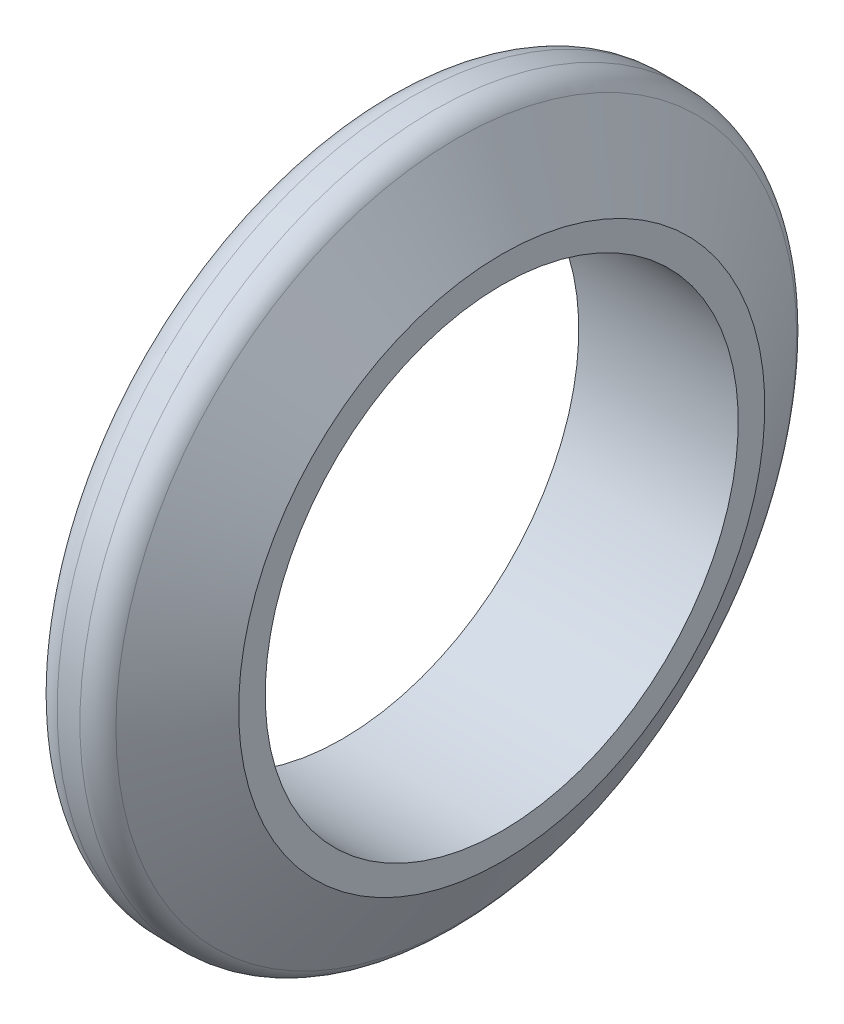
from build123d import *

# Parameters (mm, degrees)
ESQUISSE2_R             = 44.5
ENL_V_MAT_EXTRU_1_DEPTH = 99.714234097


with BuildPart() as part:
    # Esquisse1 → Base-R_volution (revolve)
    with BuildSketch(Plane.XY, mode=Mode.PRIVATE) as base_r_volution_sk:
        with BuildLine():
            Line((0, 0), (-30, 0))
            Line((-30, 0), (-30, 49.5))
            Line((-30, 49.5), (-21.449940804, 64.035100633))
            ThreePointArc((-21.449940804, 64.035100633), (-19.622657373, 65.840247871), (-17.140269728, 66.5))
            Line((-17.140269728, 66.5), (-12.859730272, 66.5))
            ThreePointArc((-12.859730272, 66.5), (-10.377342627, 65.840247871), (-8.550059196, 64.035100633))
            Line((-8.550059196, 64.035100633), (0, 49.5))
            Line((0, 49.5), (0, 0))
        make_face()
    revolve(base_r_volution_sk.sketch.rotate(Axis((-62.615525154, 0, 0), (1, 0, 0)), 180), axis=Axis((-62.615525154, 0, 0), (1, 0, 0)))

    # Esquisse2 → Enl_v. mat.-Extru.1 (cut, through all)
    with BuildSketch(Plane(origin=(0, 0, 0), x_dir=(0, 0, -1), z_dir=(1, 0, 0))):
        with Locations(Location((0, 0, 0), (0, 0, 90))):
            Circle(ESQUISSE2_R)
    extrude(amount=-ENL_V_MAT_EXTRU_1_DEPTH, mode=Mode.SUBTRACT)


solid = part.part
